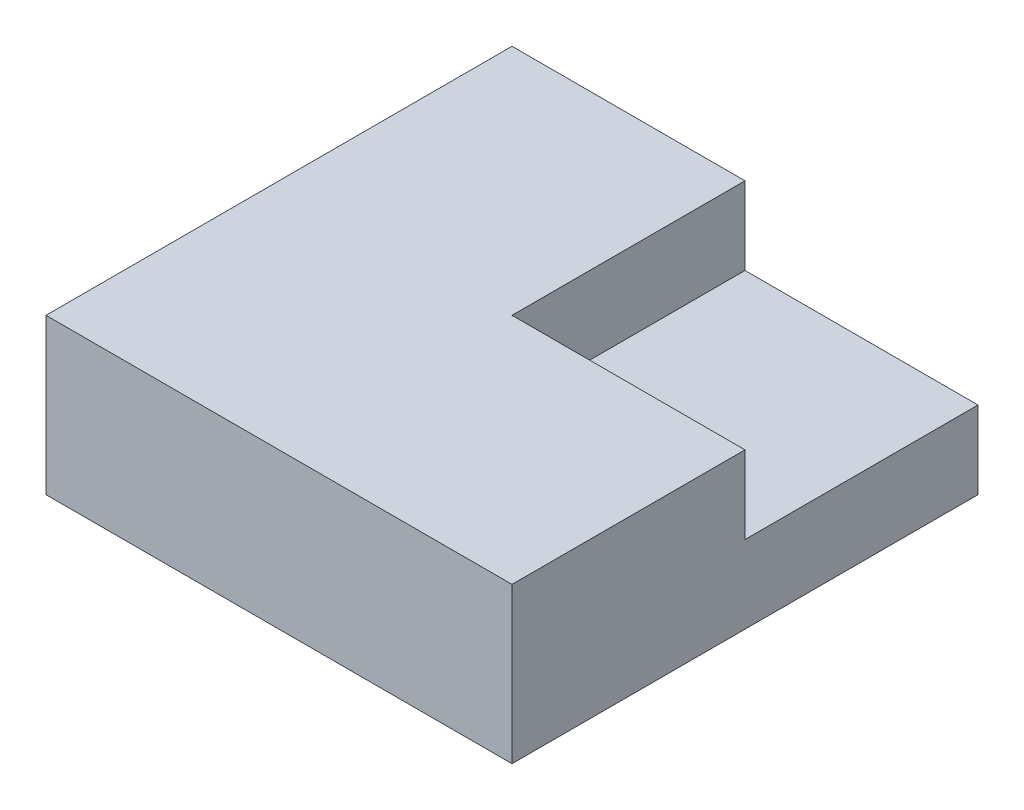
from build123d import *

# Parameters (mm, degrees)
ESQUISSE1_W             = 30
ESQUISSE1_H             = 10
EXTRUSION1_DEPTH        = 30
ESQUISSE2_W             = 15
ESQUISSE2_H             = 15
ENL_V_MAT_EXTRU_1_DEPTH = 5


with BuildPart() as part:
    # Esquisse1 → Extrusion1 (new body)
    with BuildSketch(Plane.XY):
        with Locations((15, 5)):
            Rectangle(ESQUISSE1_W, ESQUISSE1_H)
    extrude(amount=EXTRUSION1_DEPTH)

    # Esquisse2 → Enl_v. mat.-Extru.1 (cut)
    with BuildSketch(Plane(origin=(0, 10, 0), x_dir=(1, 0, 0), z_dir=(0, 1, 0))):
        with Locations((22.5, -7.5)):
            Rectangle(ESQUISSE2_W, ESQUISSE2_H)
    extrude(amount=-ENL_V_MAT_EXTRU_1_DEPTH, mode=Mode.SUBTRACT)


solid = part.part
